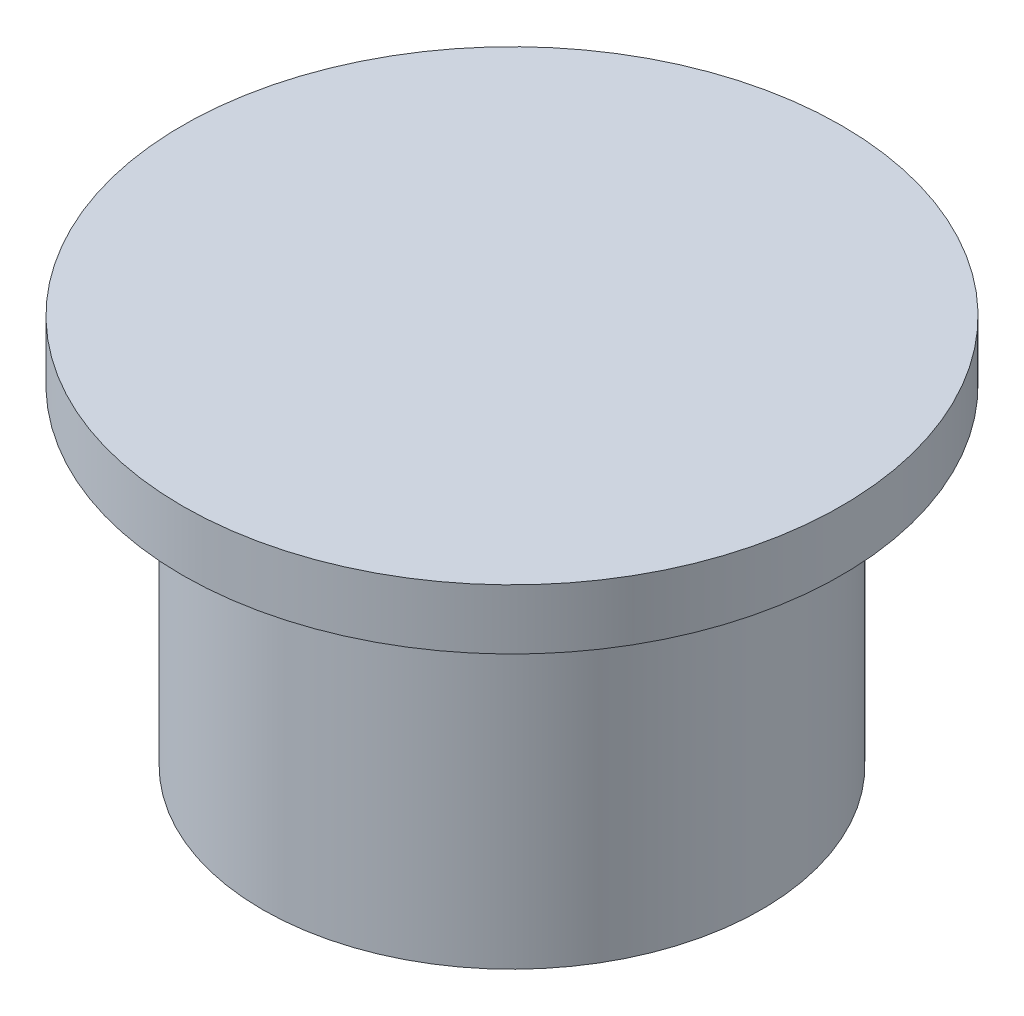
from build123d import *

# Parameters (mm, degrees)
ESQUISSE1_R      = 8.33
EXTRUSION1_DEPTH = 11
ESQUISSE2_R      = 11
EXTRUSION2_DEPTH = 2


with BuildPart() as part:
    # Esquisse1 → Extrusion1 (new body)
    with BuildSketch(Plane(origin=(0, 0, 0), x_dir=(1, 0, 0), z_dir=(0, 1, 0))):
        with Locations(Location((0, 0, 0), (0, 0, 270))):
            Circle(ESQUISSE1_R)
    extrude(amount=EXTRUSION1_DEPTH)

    # Esquisse2 → Extrusion2 (add)
    with BuildSketch(Plane(origin=(0, 11, 0), x_dir=(1, 0, 0), z_dir=(0, 1, 0))):
        with Locations(Location((0, 0, 0), (0, 0, 270))):
            Circle(ESQUISSE2_R)
    extrude(amount=EXTRUSION2_DEPTH)


solid = part.part
